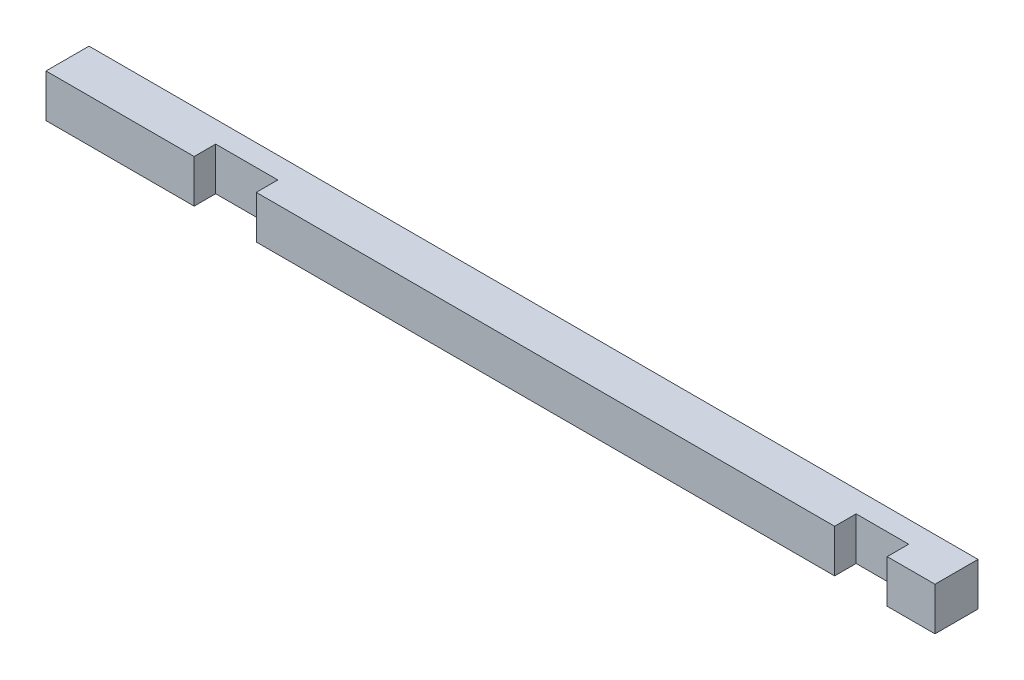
ISO-10303-21;
HEADER;
FILE_DESCRIPTION(('STEP AP214'),'2;1');
FILE_NAME('part.step','',(''),(''),'','','');
FILE_SCHEMA(('AUTOMOTIVE_DESIGN { 1 0 10303 214 1 1 1 1 }'));
ENDSEC;
DATA;
#1=APPLICATION_CONTEXT('core data for automotive mechanical design processes');
#2=APPLICATION_PROTOCOL_DEFINITION('international standard','automotive_design',2000,#1);
#3=PRODUCT_CONTEXT('',#1,'mechanical');
#4=PRODUCT('Part','Part','',(#3));
#5=PRODUCT_RELATED_PRODUCT_CATEGORY('part','',(#4));
#6=PRODUCT_DEFINITION_FORMATION('','',#4);
#7=PRODUCT_DEFINITION_CONTEXT('part definition',#1,'design');
#8=PRODUCT_DEFINITION('design','',#6,#7);
#9=PRODUCT_DEFINITION_SHAPE('','',#8);
#10=(LENGTH_UNIT() NAMED_UNIT(*) SI_UNIT(.MILLI.,.METRE.));
#11=(NAMED_UNIT(*) PLANE_ANGLE_UNIT() SI_UNIT($,.RADIAN.));
#12=(NAMED_UNIT(*) SI_UNIT($,.STERADIAN.) SOLID_ANGLE_UNIT());
#13=UNCERTAINTY_MEASURE_WITH_UNIT(LENGTH_MEASURE(1.E-05),#10,'distance_accuracy_value','');
#14=(GEOMETRIC_REPRESENTATION_CONTEXT(3) GLOBAL_UNCERTAINTY_ASSIGNED_CONTEXT((#13)) GLOBAL_UNIT_ASSIGNED_CONTEXT((#10,
#11,#12)) REPRESENTATION_CONTEXT('',''));
#15=CARTESIAN_POINT('',(0.,0.,0.));
#16=DIRECTION('',(0.,0.,1.));
#17=DIRECTION('',(1.,0.,0.));
#18=AXIS2_PLACEMENT_3D('',#15,#16,#17);
#19=CARTESIAN_POINT('',(0.,9.,9.));
#20=DIRECTION('',(0.,0.,-1.));
#21=DIRECTION('',(-1.,0.,0.));
#22=AXIS2_PLACEMENT_3D('',#19,#20,#21);
#23=PLANE('',#22);
#24=DIRECTION('',(1.,0.,0.));
#25=VECTOR('',#24,1.);
#26=CARTESIAN_POINT('',(0.,0.,9.));
#27=LINE('',#26,#25);
#28=CARTESIAN_POINT('',(44.,0.,9.));
#29=VERTEX_POINT('',#28);
#30=CARTESIAN_POINT('',(165.,0.,9.));
#31=VERTEX_POINT('',#30);
#32=EDGE_CURVE('E192',#29,#31,#27,.T.);
#33=ORIENTED_EDGE('',*,*,#32,.T.);
#34=DIRECTION('',(0.,-1.,0.));
#35=VECTOR('',#34,1.);
#36=CARTESIAN_POINT('',(165.,0.,9.));
#37=LINE('',#36,#35);
#38=CARTESIAN_POINT('',(165.,9.,9.));
#39=VERTEX_POINT('',#38);
#40=EDGE_CURVE('E126',#39,#31,#37,.T.);
#41=ORIENTED_EDGE('',*,*,#40,.F.);
#42=DIRECTION('',(-1.,0.,0.));
#43=VECTOR('',#42,1.);
#44=CARTESIAN_POINT('',(0.,9.,9.));
#45=LINE('',#44,#43);
#46=CARTESIAN_POINT('',(44.,9.,9.));
#47=VERTEX_POINT('',#46);
#48=EDGE_CURVE('E199',#39,#47,#45,.T.);
#49=ORIENTED_EDGE('',*,*,#48,.T.);
#50=DIRECTION('',(0.,1.,0.));
#51=VECTOR('',#50,1.);
#52=CARTESIAN_POINT('',(44.,0.,9.));
#53=LINE('',#52,#51);
#54=EDGE_CURVE('E162',#29,#47,#53,.T.);
#55=ORIENTED_EDGE('',*,*,#54,.F.);
#56=EDGE_LOOP('',(#33,#41,#49,#55));
#57=FACE_BOUND('',#56,.T.);
#58=ADVANCED_FACE('F31',(#57),#23,.F.);
#59=CARTESIAN_POINT('',(0.,0.,9.));
#60=VERTEX_POINT('',#59);
#61=CARTESIAN_POINT('',(31.,0.,9.));
#62=VERTEX_POINT('',#61);
#63=EDGE_CURVE('E188',#60,#62,#27,.T.);
#64=ORIENTED_EDGE('',*,*,#63,.T.);
#65=DIRECTION('',(0.,-1.,0.));
#66=VECTOR('',#65,1.);
#67=CARTESIAN_POINT('',(31.,0.,9.));
#68=LINE('',#67,#66);
#69=CARTESIAN_POINT('',(31.,9.,9.));
#70=VERTEX_POINT('',#69);
#71=EDGE_CURVE('E153',#70,#62,#68,.T.);
#72=ORIENTED_EDGE('',*,*,#71,.F.);
#73=CARTESIAN_POINT('',(0.,9.,9.));
#74=VERTEX_POINT('',#73);
#75=EDGE_CURVE('E194',#70,#74,#45,.T.);
#76=ORIENTED_EDGE('',*,*,#75,.T.);
#77=DIRECTION('',(0.,-1.,0.));
#78=VECTOR('',#77,1.);
#79=CARTESIAN_POINT('',(0.,0.,9.));
#80=LINE('',#79,#78);
#81=EDGE_CURVE('E183',#74,#60,#80,.T.);
#82=ORIENTED_EDGE('',*,*,#81,.T.);
#83=EDGE_LOOP('',(#64,#72,#76,#82));
#84=FACE_BOUND('',#83,.T.);
#85=ADVANCED_FACE('F232',(#84),#23,.F.);
#86=CARTESIAN_POINT('',(0.,0.,9.));
#87=DIRECTION('',(1.,0.,0.));
#88=DIRECTION('',(0.,0.,-1.));
#89=AXIS2_PLACEMENT_3D('',#86,#87,#88);
#90=PLANE('',#89);
#91=DIRECTION('',(0.,-1.,0.));
#92=VECTOR('',#91,1.);
#93=CARTESIAN_POINT('',(0.,0.,0.));
#94=LINE('',#93,#92);
#95=CARTESIAN_POINT('',(0.,9.,0.));
#96=VERTEX_POINT('',#95);
#97=CARTESIAN_POINT('',(0.,0.,0.));
#98=VERTEX_POINT('',#97);
#99=EDGE_CURVE('E176',#96,#98,#94,.T.);
#100=ORIENTED_EDGE('',*,*,#99,.T.);
#101=DIRECTION('',(0.,0.,-1.));
#102=VECTOR('',#101,1.);
#103=CARTESIAN_POINT('',(0.,0.,9.));
#104=LINE('',#103,#102);
#105=EDGE_CURVE('E11',#60,#98,#104,.T.);
#106=ORIENTED_EDGE('',*,*,#105,.F.);
#107=ORIENTED_EDGE('',*,*,#81,.F.);
#108=DIRECTION('',(0.,0.,-1.));
#109=VECTOR('',#108,1.);
#110=CARTESIAN_POINT('',(0.,9.,9.));
#111=LINE('',#110,#109);
#112=EDGE_CURVE('E198',#74,#96,#111,.T.);
#113=ORIENTED_EDGE('',*,*,#112,.T.);
#114=EDGE_LOOP('',(#100,#106,#107,#113));
#115=FACE_BOUND('',#114,.T.);
#116=ADVANCED_FACE('F33',(#115),#90,.F.);
#117=CARTESIAN_POINT('',(0.,0.,9.));
#118=DIRECTION('',(0.,1.,0.));
#119=DIRECTION('',(0.,0.,1.));
#120=AXIS2_PLACEMENT_3D('',#117,#118,#119);
#121=PLANE('',#120);
#122=DIRECTION('',(1.,0.,0.));
#123=VECTOR('',#122,1.);
#124=CARTESIAN_POINT('',(165.,0.,4.5));
#125=LINE('',#124,#123);
#126=CARTESIAN_POINT('',(165.,0.,4.5));
#127=VERTEX_POINT('',#126);
#128=CARTESIAN_POINT('',(176.,0.,4.5));
#129=VERTEX_POINT('',#128);
#130=EDGE_CURVE('E137',#127,#129,#125,.T.);
#131=ORIENTED_EDGE('',*,*,#130,.F.);
#132=DIRECTION('',(0.,0.,1.));
#133=VECTOR('',#132,1.);
#134=CARTESIAN_POINT('',(165.,0.,4.5));
#135=LINE('',#134,#133);
#136=EDGE_CURVE('E120',#127,#31,#135,.T.);
#137=ORIENTED_EDGE('',*,*,#136,.T.);
#138=ORIENTED_EDGE('',*,*,#32,.F.);
#139=DIRECTION('',(0.,0.,1.));
#140=VECTOR('',#139,1.);
#141=CARTESIAN_POINT('',(44.,0.,4.5));
#142=LINE('',#141,#140);
#143=CARTESIAN_POINT('',(44.,0.,4.5));
#144=VERTEX_POINT('',#143);
#145=EDGE_CURVE('E54',#144,#29,#142,.T.);
#146=ORIENTED_EDGE('',*,*,#145,.F.);
#147=DIRECTION('',(1.,0.,0.));
#148=VECTOR('',#147,1.);
#149=CARTESIAN_POINT('',(31.,0.,4.5));
#150=LINE('',#149,#148);
#151=CARTESIAN_POINT('',(31.,0.,4.5));
#152=VERTEX_POINT('',#151);
#153=EDGE_CURVE('E161',#152,#144,#150,.T.);
#154=ORIENTED_EDGE('',*,*,#153,.F.);
#155=DIRECTION('',(0.,0.,1.));
#156=VECTOR('',#155,1.);
#157=CARTESIAN_POINT('',(31.,0.,4.5));
#158=LINE('',#157,#156);
#159=EDGE_CURVE('E171',#152,#62,#158,.T.);
#160=ORIENTED_EDGE('',*,*,#159,.T.);
#161=ORIENTED_EDGE('',*,*,#63,.F.);
#162=ORIENTED_EDGE('',*,*,#105,.T.);
#163=DIRECTION('',(1.,0.,0.));
#164=VECTOR('',#163,1.);
#165=CARTESIAN_POINT('',(0.,0.,0.));
#166=LINE('',#165,#164);
#167=CARTESIAN_POINT('',(186.,0.,0.));
#168=VERTEX_POINT('',#167);
#169=EDGE_CURVE('E202',#98,#168,#166,.T.);
#170=ORIENTED_EDGE('',*,*,#169,.T.);
#171=DIRECTION('',(0.,0.,-1.));
#172=VECTOR('',#171,1.);
#173=CARTESIAN_POINT('',(186.,0.,9.));
#174=LINE('',#173,#172);
#175=CARTESIAN_POINT('',(186.,0.,9.));
#176=VERTEX_POINT('',#175);
#177=EDGE_CURVE('E39',#176,#168,#174,.T.);
#178=ORIENTED_EDGE('',*,*,#177,.F.);
#179=CARTESIAN_POINT('',(176.,0.,9.));
#180=VERTEX_POINT('',#179);
#181=EDGE_CURVE('E186',#180,#176,#27,.T.);
#182=ORIENTED_EDGE('',*,*,#181,.F.);
#183=DIRECTION('',(0.,0.,1.));
#184=VECTOR('',#183,1.);
#185=CARTESIAN_POINT('',(176.,0.,4.5));
#186=LINE('',#185,#184);
#187=EDGE_CURVE('E46',#129,#180,#186,.T.);
#188=ORIENTED_EDGE('',*,*,#187,.F.);
#189=EDGE_LOOP('',(#131,#137,#138,#146,#154,#160,#161,#162,#170,#178,#182,#188));
#190=FACE_BOUND('',#189,.T.);
#191=ADVANCED_FACE('F142',(#190),#121,.F.);
#192=CARTESIAN_POINT('',(186.,0.,9.));
#193=DIRECTION('',(-1.,0.,0.));
#194=DIRECTION('',(0.,0.,1.));
#195=AXIS2_PLACEMENT_3D('',#192,#193,#194);
#196=PLANE('',#195);
#197=DIRECTION('',(0.,1.,0.));
#198=VECTOR('',#197,1.);
#199=CARTESIAN_POINT('',(186.,0.,0.));
#200=LINE('',#199,#198);
#201=CARTESIAN_POINT('',(186.,9.,0.));
#202=VERTEX_POINT('',#201);
#203=EDGE_CURVE('E204',#168,#202,#200,.T.);
#204=ORIENTED_EDGE('',*,*,#203,.T.);
#205=DIRECTION('',(0.,0.,-1.));
#206=VECTOR('',#205,1.);
#207=CARTESIAN_POINT('',(186.,9.,9.));
#208=LINE('',#207,#206);
#209=CARTESIAN_POINT('',(186.,9.,9.));
#210=VERTEX_POINT('',#209);
#211=EDGE_CURVE('E209',#210,#202,#208,.T.);
#212=ORIENTED_EDGE('',*,*,#211,.F.);
#213=DIRECTION('',(0.,1.,0.));
#214=VECTOR('',#213,1.);
#215=CARTESIAN_POINT('',(186.,0.,9.));
#216=LINE('',#215,#214);
#217=EDGE_CURVE('E191',#176,#210,#216,.T.);
#218=ORIENTED_EDGE('',*,*,#217,.F.);
#219=ORIENTED_EDGE('',*,*,#177,.T.);
#220=EDGE_LOOP('',(#204,#212,#218,#219));
#221=FACE_BOUND('',#220,.T.);
#222=ADVANCED_FACE('F216',(#221),#196,.F.);
#223=CARTESIAN_POINT('',(0.,9.,9.));
#224=DIRECTION('',(0.,-1.,0.));
#225=DIRECTION('',(0.,0.,-1.));
#226=AXIS2_PLACEMENT_3D('',#223,#224,#225);
#227=PLANE('',#226);
#228=ORIENTED_EDGE('',*,*,#48,.F.);
#229=DIRECTION('',(0.,0.,1.));
#230=VECTOR('',#229,1.);
#231=CARTESIAN_POINT('',(165.,9.,4.5));
#232=LINE('',#231,#230);
#233=CARTESIAN_POINT('',(165.,9.,4.5));
#234=VERTEX_POINT('',#233);
#235=EDGE_CURVE('E151',#234,#39,#232,.T.);
#236=ORIENTED_EDGE('',*,*,#235,.F.);
#237=DIRECTION('',(-1.,0.,0.));
#238=VECTOR('',#237,1.);
#239=CARTESIAN_POINT('',(165.,9.,4.5));
#240=LINE('',#239,#238);
#241=CARTESIAN_POINT('',(176.,9.,4.5));
#242=VERTEX_POINT('',#241);
#243=EDGE_CURVE('E131',#242,#234,#240,.T.);
#244=ORIENTED_EDGE('',*,*,#243,.F.);
#245=DIRECTION('',(0.,0.,1.));
#246=VECTOR('',#245,1.);
#247=CARTESIAN_POINT('',(176.,9.,4.5));
#248=LINE('',#247,#246);
#249=CARTESIAN_POINT('',(176.,9.,9.));
#250=VERTEX_POINT('',#249);
#251=EDGE_CURVE('E154',#242,#250,#248,.T.);
#252=ORIENTED_EDGE('',*,*,#251,.T.);
#253=EDGE_CURVE('E195',#210,#250,#45,.T.);
#254=ORIENTED_EDGE('',*,*,#253,.F.);
#255=ORIENTED_EDGE('',*,*,#211,.T.);
#256=DIRECTION('',(-1.,0.,0.));
#257=VECTOR('',#256,1.);
#258=CARTESIAN_POINT('',(0.,9.,0.));
#259=LINE('',#258,#257);
#260=EDGE_CURVE('E187',#202,#96,#259,.T.);
#261=ORIENTED_EDGE('',*,*,#260,.T.);
#262=ORIENTED_EDGE('',*,*,#112,.F.);
#263=ORIENTED_EDGE('',*,*,#75,.F.);
#264=DIRECTION('',(0.,0.,1.));
#265=VECTOR('',#264,1.);
#266=CARTESIAN_POINT('',(31.,9.,4.5));
#267=LINE('',#266,#265);
#268=CARTESIAN_POINT('',(31.,9.,4.5));
#269=VERTEX_POINT('',#268);
#270=EDGE_CURVE('E174',#269,#70,#267,.T.);
#271=ORIENTED_EDGE('',*,*,#270,.F.);
#272=DIRECTION('',(-1.,0.,0.));
#273=VECTOR('',#272,1.);
#274=CARTESIAN_POINT('',(31.,9.,4.5));
#275=LINE('',#274,#273);
#276=CARTESIAN_POINT('',(44.,9.,4.5));
#277=VERTEX_POINT('',#276);
#278=EDGE_CURVE('E168',#277,#269,#275,.T.);
#279=ORIENTED_EDGE('',*,*,#278,.F.);
#280=DIRECTION('',(0.,0.,1.));
#281=VECTOR('',#280,1.);
#282=CARTESIAN_POINT('',(44.,9.,4.5));
#283=LINE('',#282,#281);
#284=EDGE_CURVE('E177',#277,#47,#283,.T.);
#285=ORIENTED_EDGE('',*,*,#284,.T.);
#286=EDGE_LOOP('',(#228,#236,#244,#252,#254,#255,#261,#262,#263,#271,#279,#285));
#287=FACE_BOUND('',#286,.T.);
#288=ADVANCED_FACE('F225',(#287),#227,.F.);
#289=ORIENTED_EDGE('',*,*,#253,.T.);
#290=DIRECTION('',(0.,1.,0.));
#291=VECTOR('',#290,1.);
#292=CARTESIAN_POINT('',(176.,0.,9.));
#293=LINE('',#292,#291);
#294=EDGE_CURVE('E140',#180,#250,#293,.T.);
#295=ORIENTED_EDGE('',*,*,#294,.F.);
#296=ORIENTED_EDGE('',*,*,#181,.T.);
#297=ORIENTED_EDGE('',*,*,#217,.T.);
#298=EDGE_LOOP('',(#289,#295,#296,#297));
#299=FACE_BOUND('',#298,.T.);
#300=ADVANCED_FACE('F242',(#299),#23,.F.);
#301=CARTESIAN_POINT('',(0.,9.,0.));
#302=DIRECTION('',(0.,0.,-1.));
#303=DIRECTION('',(-1.,0.,0.));
#304=AXIS2_PLACEMENT_3D('',#301,#302,#303);
#305=PLANE('',#304);
#306=ORIENTED_EDGE('',*,*,#99,.F.);
#307=ORIENTED_EDGE('',*,*,#260,.F.);
#308=ORIENTED_EDGE('',*,*,#203,.F.);
#309=ORIENTED_EDGE('',*,*,#169,.F.);
#310=EDGE_LOOP('',(#306,#307,#308,#309));
#311=FACE_BOUND('',#310,.T.);
#312=ADVANCED_FACE('F221',(#311),#305,.T.);
#313=CARTESIAN_POINT('',(31.,0.,4.5));
#314=DIRECTION('',(-1.,0.,0.));
#315=DIRECTION('',(0.,0.,1.));
#316=AXIS2_PLACEMENT_3D('',#313,#314,#315);
#317=PLANE('',#316);
#318=ORIENTED_EDGE('',*,*,#71,.T.);
#319=ORIENTED_EDGE('',*,*,#159,.F.);
#320=DIRECTION('',(0.,-1.,0.));
#321=VECTOR('',#320,1.);
#322=CARTESIAN_POINT('',(31.,0.,4.5));
#323=LINE('',#322,#321);
#324=EDGE_CURVE('E158',#269,#152,#323,.T.);
#325=ORIENTED_EDGE('',*,*,#324,.F.);
#326=ORIENTED_EDGE('',*,*,#270,.T.);
#327=EDGE_LOOP('',(#318,#319,#325,#326));
#328=FACE_BOUND('',#327,.T.);
#329=ADVANCED_FACE('F264',(#328),#317,.F.);
#330=CARTESIAN_POINT('',(44.,0.,4.5));
#331=DIRECTION('',(1.,0.,0.));
#332=DIRECTION('',(0.,0.,-1.));
#333=AXIS2_PLACEMENT_3D('',#330,#331,#332);
#334=PLANE('',#333);
#335=ORIENTED_EDGE('',*,*,#54,.T.);
#336=ORIENTED_EDGE('',*,*,#284,.F.);
#337=DIRECTION('',(0.,1.,0.));
#338=VECTOR('',#337,1.);
#339=CARTESIAN_POINT('',(44.,0.,4.5));
#340=LINE('',#339,#338);
#341=EDGE_CURVE('E165',#144,#277,#340,.T.);
#342=ORIENTED_EDGE('',*,*,#341,.F.);
#343=ORIENTED_EDGE('',*,*,#145,.T.);
#344=EDGE_LOOP('',(#335,#336,#342,#343));
#345=FACE_BOUND('',#344,.T.);
#346=ADVANCED_FACE('F236',(#345),#334,.F.);
#347=CARTESIAN_POINT('',(31.,9.,4.5));
#348=DIRECTION('',(0.,0.,-1.));
#349=DIRECTION('',(-1.,0.,0.));
#350=AXIS2_PLACEMENT_3D('',#347,#348,#349);
#351=PLANE('',#350);
#352=ORIENTED_EDGE('',*,*,#324,.T.);
#353=ORIENTED_EDGE('',*,*,#153,.T.);
#354=ORIENTED_EDGE('',*,*,#341,.T.);
#355=ORIENTED_EDGE('',*,*,#278,.T.);
#356=EDGE_LOOP('',(#352,#353,#354,#355));
#357=FACE_BOUND('',#356,.T.);
#358=ADVANCED_FACE('F239',(#357),#351,.F.);
#359=CARTESIAN_POINT('',(165.,0.,4.5));
#360=DIRECTION('',(-1.,0.,0.));
#361=DIRECTION('',(0.,0.,1.));
#362=AXIS2_PLACEMENT_3D('',#359,#360,#361);
#363=PLANE('',#362);
#364=ORIENTED_EDGE('',*,*,#40,.T.);
#365=ORIENTED_EDGE('',*,*,#136,.F.);
#366=DIRECTION('',(0.,-1.,0.));
#367=VECTOR('',#366,1.);
#368=CARTESIAN_POINT('',(165.,0.,4.5));
#369=LINE('',#368,#367);
#370=EDGE_CURVE('E123',#234,#127,#369,.T.);
#371=ORIENTED_EDGE('',*,*,#370,.F.);
#372=ORIENTED_EDGE('',*,*,#235,.T.);
#373=EDGE_LOOP('',(#364,#365,#371,#372));
#374=FACE_BOUND('',#373,.T.);
#375=ADVANCED_FACE('F122',(#374),#363,.F.);
#376=CARTESIAN_POINT('',(176.,0.,4.5));
#377=DIRECTION('',(1.,0.,0.));
#378=DIRECTION('',(0.,0.,-1.));
#379=AXIS2_PLACEMENT_3D('',#376,#377,#378);
#380=PLANE('',#379);
#381=ORIENTED_EDGE('',*,*,#294,.T.);
#382=ORIENTED_EDGE('',*,*,#251,.F.);
#383=DIRECTION('',(0.,1.,0.));
#384=VECTOR('',#383,1.);
#385=CARTESIAN_POINT('',(176.,0.,4.5));
#386=LINE('',#385,#384);
#387=EDGE_CURVE('E144',#129,#242,#386,.T.);
#388=ORIENTED_EDGE('',*,*,#387,.F.);
#389=ORIENTED_EDGE('',*,*,#187,.T.);
#390=EDGE_LOOP('',(#381,#382,#388,#389));
#391=FACE_BOUND('',#390,.T.);
#392=ADVANCED_FACE('F243',(#391),#380,.F.);
#393=CARTESIAN_POINT('',(165.,9.,4.5));
#394=DIRECTION('',(0.,0.,-1.));
#395=DIRECTION('',(-1.,0.,0.));
#396=AXIS2_PLACEMENT_3D('',#393,#394,#395);
#397=PLANE('',#396);
#398=ORIENTED_EDGE('',*,*,#370,.T.);
#399=ORIENTED_EDGE('',*,*,#130,.T.);
#400=ORIENTED_EDGE('',*,*,#387,.T.);
#401=ORIENTED_EDGE('',*,*,#243,.T.);
#402=EDGE_LOOP('',(#398,#399,#400,#401));
#403=FACE_BOUND('',#402,.T.);
#404=ADVANCED_FACE('F135',(#403),#397,.F.);
#405=CLOSED_SHELL('',(#58,#85,#116,#191,#222,#288,#300,#312,#329,#346,#358,#375,#392,#404));
#406=MANIFOLD_SOLID_BREP('B2',#405);
#407=ADVANCED_BREP_SHAPE_REPRESENTATION('',(#18,#406),#14);
#408=SHAPE_DEFINITION_REPRESENTATION(#9,#407);
ENDSEC;
END-ISO-10303-21;
